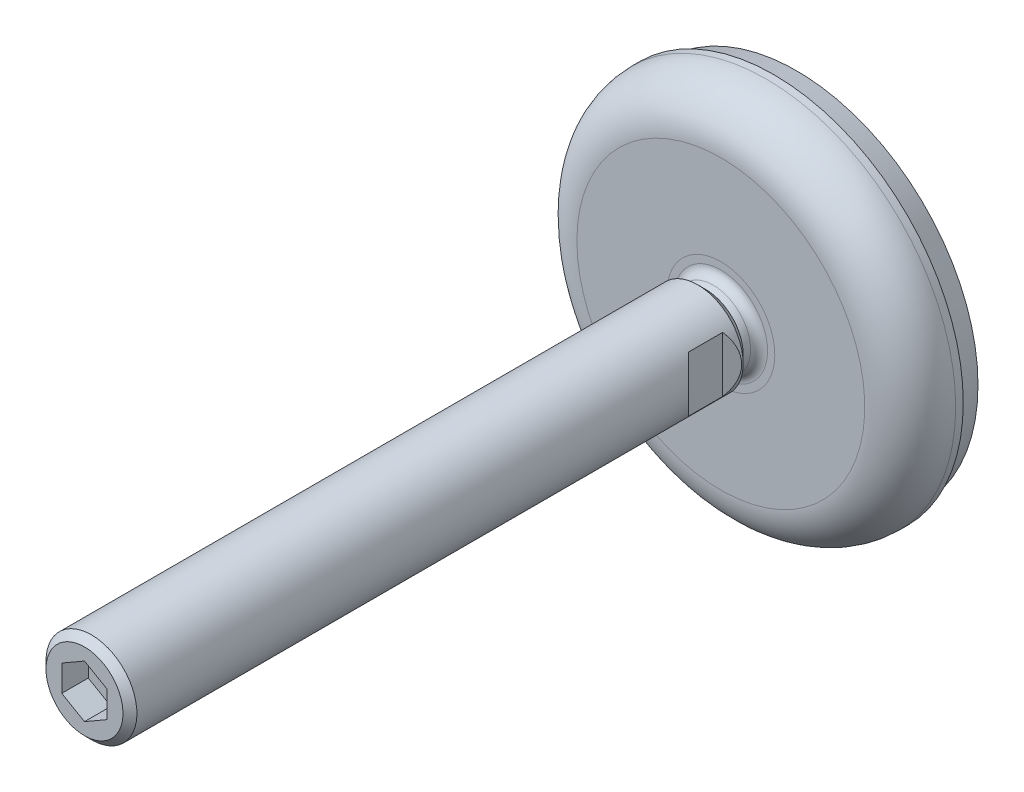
ISO-10303-21;
HEADER;
FILE_DESCRIPTION(('STEP AP214'),'2;1');
FILE_NAME('part.step','',(''),(''),'','','');
FILE_SCHEMA(('AUTOMOTIVE_DESIGN { 1 0 10303 214 1 1 1 1 }'));
ENDSEC;
DATA;
#1=APPLICATION_CONTEXT('core data for automotive mechanical design processes');
#2=APPLICATION_PROTOCOL_DEFINITION('international standard','automotive_design',2000,#1);
#3=PRODUCT_CONTEXT('',#1,'mechanical');
#4=PRODUCT('Part','Part','',(#3));
#5=PRODUCT_RELATED_PRODUCT_CATEGORY('part','',(#4));
#6=PRODUCT_DEFINITION_FORMATION('','',#4);
#7=PRODUCT_DEFINITION_CONTEXT('part definition',#1,'design');
#8=PRODUCT_DEFINITION('design','',#6,#7);
#9=PRODUCT_DEFINITION_SHAPE('','',#8);
#10=(LENGTH_UNIT() NAMED_UNIT(*) SI_UNIT(.MILLI.,.METRE.));
#11=(NAMED_UNIT(*) PLANE_ANGLE_UNIT() SI_UNIT($,.RADIAN.));
#12=(NAMED_UNIT(*) SI_UNIT($,.STERADIAN.) SOLID_ANGLE_UNIT());
#13=UNCERTAINTY_MEASURE_WITH_UNIT(LENGTH_MEASURE(1.E-05),#10,'distance_accuracy_value','');
#14=(GEOMETRIC_REPRESENTATION_CONTEXT(3) GLOBAL_UNCERTAINTY_ASSIGNED_CONTEXT((#13)) GLOBAL_UNIT_ASSIGNED_CONTEXT((#10,
#11,#12)) REPRESENTATION_CONTEXT('',''));
#15=CARTESIAN_POINT('',(0.,0.,0.));
#16=DIRECTION('',(0.,0.,1.));
#17=DIRECTION('',(1.,0.,0.));
#18=AXIS2_PLACEMENT_3D('',#15,#16,#17);
#19=CARTESIAN_POINT('',(0.,0.,19.908154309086));
#20=DIRECTION('',(0.,0.,1.));
#21=DIRECTION('',(1.,0.,0.));
#22=AXIS2_PLACEMENT_3D('',#19,#20,#21);
#23=DEGENERATE_TOROIDAL_SURFACE('',#22,0.909116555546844,11.,.F.);
#24=CARTESIAN_POINT('',(0.,0.,22.0200285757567));
#25=DIRECTION('',(0.,0.,1.));
#26=DIRECTION('',(1.,0.,0.));
#27=AXIS2_PLACEMENT_3D('',#24,#25,#26);
#28=CIRCLE('',#27,9.88625222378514);
#29=CARTESIAN_POINT('',(9.88625222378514,0.,22.0200285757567));
#30=VERTEX_POINT('',#29);
#31=EDGE_CURVE('E481',#30,#30,#28,.T.);
#32=ORIENTED_EDGE('',*,*,#31,.T.);
#33=EDGE_LOOP('',(#32));
#34=FACE_BOUND('',#33,.T.);
#35=CARTESIAN_POINT('',(0.,0.,24.));
#36=DIRECTION('',(0.,0.,1.));
#37=DIRECTION('',(1.,0.,0.));
#38=AXIS2_PLACEMENT_3D('',#35,#36,#37);
#39=CIRCLE('',#38,9.30150530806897);
#40=CARTESIAN_POINT('',(9.30150530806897,0.,24.));
#41=VERTEX_POINT('',#40);
#42=EDGE_CURVE('E429',#41,#41,#39,.F.);
#43=ORIENTED_EDGE('',*,*,#42,.T.);
#44=EDGE_LOOP('',(#43));
#45=FACE_BOUND('',#44,.T.);
#46=ADVANCED_FACE('F14',(#34,#45),#23,.F.);
#47=CARTESIAN_POINT('',(0.,0.,22.5));
#48=DIRECTION('',(0.,0.,1.));
#49=DIRECTION('',(1.,0.,0.));
#50=AXIS2_PLACEMENT_3D('',#47,#48,#49);
#51=TOROIDAL_SURFACE('',#50,12.3397451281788,2.5);
#52=CARTESIAN_POINT('',(0.,0.,20.));
#53=DIRECTION('',(0.,0.,1.));
#54=DIRECTION('',(1.,0.,0.));
#55=AXIS2_PLACEMENT_3D('',#52,#53,#54);
#56=CIRCLE('',#55,12.3397451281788);
#57=CARTESIAN_POINT('',(12.3397451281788,0.,20.));
#58=VERTEX_POINT('',#57);
#59=EDGE_CURVE('E478',#58,#58,#56,.T.);
#60=ORIENTED_EDGE('',*,*,#59,.T.);
#61=EDGE_LOOP('',(#60));
#62=FACE_BOUND('',#61,.T.);
#63=ORIENTED_EDGE('',*,*,#31,.F.);
#64=EDGE_LOOP('',(#63));
#65=FACE_BOUND('',#64,.T.);
#66=ADVANCED_FACE('F164',(#62,#65),#51,.F.);
#67=CARTESIAN_POINT('',(-12.3397451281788,0.,20.));
#68=DIRECTION('',(0.,0.,1.));
#69=DIRECTION('',(1.,0.,0.));
#70=AXIS2_PLACEMENT_3D('',#67,#68,#69);
#71=PLANE('',#70);
#72=CARTESIAN_POINT('',(0.,0.,20.));
#73=DIRECTION('',(0.,0.,1.));
#74=DIRECTION('',(1.,0.,0.));
#75=AXIS2_PLACEMENT_3D('',#72,#73,#74);
#76=CIRCLE('',#75,14.2492451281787);
#77=CARTESIAN_POINT('',(14.2492451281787,0.,20.));
#78=VERTEX_POINT('',#77);
#79=EDGE_CURVE('E432',#78,#78,#76,.T.);
#80=ORIENTED_EDGE('',*,*,#79,.T.);
#81=EDGE_LOOP('',(#80));
#82=FACE_BOUND('',#81,.T.);
#83=ORIENTED_EDGE('',*,*,#59,.F.);
#84=EDGE_LOOP('',(#83));
#85=FACE_BOUND('',#84,.T.);
#86=ADVANCED_FACE('F171',(#82,#85),#71,.T.);
#87=CARTESIAN_POINT('',(-48.4670146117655,-47.8923048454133,0.));
#88=DIRECTION('',(0.,0.,-1.));
#89=DIRECTION('',(0.,1.,0.));
#90=AXIS2_PLACEMENT_3D('',#87,#88,#89);
#91=PLANE('',#90);
#92=CARTESIAN_POINT('',(0.,0.,0.));
#93=DIRECTION('',(0.,0.,1.));
#94=DIRECTION('',(1.,0.,0.));
#95=AXIS2_PLACEMENT_3D('',#92,#93,#94);
#96=CIRCLE('',#95,47.8923048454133);
#97=CARTESIAN_POINT('',(47.8923048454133,0.,0.));
#98=VERTEX_POINT('',#97);
#99=EDGE_CURVE('E416',#98,#98,#96,.T.);
#100=ORIENTED_EDGE('',*,*,#99,.F.);
#101=EDGE_LOOP('',(#100));
#102=FACE_BOUND('',#101,.T.);
#103=ADVANCED_FACE('F299',(#102),#91,.T.);
#104=CARTESIAN_POINT('',(0.,0.,0.));
#105=DIRECTION('',(0.,0.,1.));
#106=DIRECTION('',(1.,0.,0.));
#107=AXIS2_PLACEMENT_3D('',#104,#105,#106);
#108=CONICAL_SURFACE('',#107,47.8923048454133,0.261799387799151);
#109=CARTESIAN_POINT('',(0.,0.,6.));
#110=DIRECTION('',(0.,0.,1.));
#111=DIRECTION('',(1.,0.,0.));
#112=AXIS2_PLACEMENT_3D('',#109,#110,#111);
#113=CIRCLE('',#112,49.5);
#114=CARTESIAN_POINT('',(49.5,0.,6.));
#115=VERTEX_POINT('',#114);
#116=EDGE_CURVE('E420',#115,#115,#113,.F.);
#117=ORIENTED_EDGE('',*,*,#116,.T.);
#118=EDGE_LOOP('',(#117));
#119=FACE_BOUND('',#118,.T.);
#120=ORIENTED_EDGE('',*,*,#99,.T.);
#121=EDGE_LOOP('',(#120));
#122=FACE_BOUND('',#121,.T.);
#123=ADVANCED_FACE('F16',(#119,#122),#108,.T.);
#124=CARTESIAN_POINT('',(-50.6000021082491,-50.,6.));
#125=DIRECTION('',(0.,0.,-1.));
#126=DIRECTION('',(0.,1.,0.));
#127=AXIS2_PLACEMENT_3D('',#124,#125,#126);
#128=PLANE('',#127);
#129=ORIENTED_EDGE('',*,*,#116,.F.);
#130=EDGE_LOOP('',(#129));
#131=FACE_BOUND('',#130,.T.);
#132=CARTESIAN_POINT('',(0.,0.,6.));
#133=DIRECTION('',(0.,0.,-1.));
#134=DIRECTION('',(-1.,0.,0.));
#135=AXIS2_PLACEMENT_3D('',#132,#133,#134);
#136=CIRCLE('',#135,50.);
#137=CARTESIAN_POINT('',(-50.,0.,6.));
#138=VERTEX_POINT('',#137);
#139=EDGE_CURVE('E410',#138,#138,#136,.T.);
#140=ORIENTED_EDGE('',*,*,#139,.T.);
#141=EDGE_LOOP('',(#140));
#142=FACE_BOUND('',#141,.T.);
#143=ADVANCED_FACE('F284',(#131,#142),#128,.T.);
#144=CARTESIAN_POINT('',(0.,0.,6.));
#145=DIRECTION('',(0.,0.,-1.));
#146=DIRECTION('',(-1.,0.,0.));
#147=AXIS2_PLACEMENT_3D('',#144,#145,#146);
#148=CYLINDRICAL_SURFACE('',#147,50.);
#149=ORIENTED_EDGE('',*,*,#139,.F.);
#150=EDGE_LOOP('',(#149));
#151=FACE_BOUND('',#150,.T.);
#152=CARTESIAN_POINT('',(0.,0.,8.));
#153=DIRECTION('',(0.,0.,-1.));
#154=DIRECTION('',(0.,1.,0.));
#155=AXIS2_PLACEMENT_3D('',#152,#153,#154);
#156=CIRCLE('',#155,50.);
#157=CARTESIAN_POINT('',(0.,50.,8.));
#158=VERTEX_POINT('',#157);
#159=EDGE_CURVE('E407',#158,#158,#156,.T.);
#160=ORIENTED_EDGE('',*,*,#159,.T.);
#161=EDGE_LOOP('',(#160));
#162=FACE_BOUND('',#161,.T.);
#163=ADVANCED_FACE('F276',(#151,#162),#148,.T.);
#164=CARTESIAN_POINT('',(0.,0.,8.));
#165=DIRECTION('',(0.,0.,-1.));
#166=DIRECTION('',(-1.,0.,0.));
#167=AXIS2_PLACEMENT_3D('',#164,#165,#166);
#168=TOROIDAL_SURFACE('',#167,38.,12.);
#169=CARTESIAN_POINT('',(0.,0.,20.));
#170=DIRECTION('',(0.,0.,-1.));
#171=DIRECTION('',(-1.,0.,0.));
#172=AXIS2_PLACEMENT_3D('',#169,#170,#171);
#173=CIRCLE('',#172,38.);
#174=CARTESIAN_POINT('',(-38.,0.,20.));
#175=VERTEX_POINT('',#174);
#176=EDGE_CURVE('E411',#175,#175,#173,.T.);
#177=ORIENTED_EDGE('',*,*,#176,.T.);
#178=EDGE_LOOP('',(#177));
#179=FACE_BOUND('',#178,.T.);
#180=ORIENTED_EDGE('',*,*,#159,.F.);
#181=EDGE_LOOP('',(#180));
#182=FACE_BOUND('',#181,.T.);
#183=ADVANCED_FACE('F268',(#179,#182),#168,.T.);
#184=CARTESIAN_POINT('',(-38.,38.,20.));
#185=CARTESIAN_POINT('',(-38.,-38.,20.));
#186=CARTESIAN_POINT('',(-38.,-38.76,20.));
#187=B_SPLINE_CURVE_WITH_KNOTS('',1,(#184,#185,#186),.UNSPECIFIED.,.F.,.F.,(2,1,2),(0.,1.,1.01),.UNSPECIFIED.);
#188=DIRECTION('',(1.,0.,0.));
#189=VECTOR('',#188,1.);
#190=SURFACE_OF_LINEAR_EXTRUSION('',#187,#189);
#191=ORIENTED_EDGE('',*,*,#79,.F.);
#192=EDGE_LOOP('',(#191));
#193=FACE_BOUND('',#192,.T.);
#194=ORIENTED_EDGE('',*,*,#176,.F.);
#195=EDGE_LOOP('',(#194));
#196=FACE_BOUND('',#195,.T.);
#197=ADVANCED_FACE('F260',(#193,#196),#190,.T.);
#198=CARTESIAN_POINT('',(0.,0.,24.));
#199=DIRECTION('',(0.,0.,1.));
#200=DIRECTION('',(1.,0.,0.));
#201=AXIS2_PLACEMENT_3D('',#198,#199,#200);
#202=PLANE('',#201);
#203=ORIENTED_EDGE('',*,*,#42,.F.);
#204=EDGE_LOOP('',(#203));
#205=FACE_BOUND('',#204,.T.);
#206=CARTESIAN_POINT('',(0.,0.,24.));
#207=DIRECTION('',(0.,0.,1.));
#208=DIRECTION('',(1.,0.,0.));
#209=AXIS2_PLACEMENT_3D('',#206,#207,#208);
#210=CIRCLE('',#209,9.9);
#211=CARTESIAN_POINT('',(9.9,0.,24.));
#212=VERTEX_POINT('',#211);
#213=EDGE_CURVE('E433',#212,#212,#210,.T.);
#214=ORIENTED_EDGE('',*,*,#213,.F.);
#215=EDGE_LOOP('',(#214));
#216=FACE_BOUND('',#215,.T.);
#217=ADVANCED_FACE('F252',(#205,#216),#202,.F.);
#218=CARTESIAN_POINT('',(0.,0.,24.));
#219=DIRECTION('',(0.,0.,1.));
#220=DIRECTION('',(1.,0.,0.));
#221=AXIS2_PLACEMENT_3D('',#218,#219,#220);
#222=CONICAL_SURFACE('',#221,9.9,0.785398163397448);
#223=CARTESIAN_POINT('',(0.,0.,26.1));
#224=DIRECTION('',(0.,0.,1.));
#225=DIRECTION('',(1.,0.,0.));
#226=AXIS2_PLACEMENT_3D('',#223,#224,#225);
#227=CIRCLE('',#226,12.);
#228=CARTESIAN_POINT('',(12.,0.,26.1));
#229=VERTEX_POINT('',#228);
#230=EDGE_CURVE('E469',#229,#229,#227,.T.);
#231=ORIENTED_EDGE('',*,*,#230,.F.);
#232=EDGE_LOOP('',(#231));
#233=FACE_BOUND('',#232,.T.);
#234=ORIENTED_EDGE('',*,*,#213,.T.);
#235=EDGE_LOOP('',(#234));
#236=FACE_BOUND('',#235,.T.);
#237=ADVANCED_FACE('F181',(#233,#236),#222,.T.);
#238=CARTESIAN_POINT('',(-6.,-7.01134166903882,181.));
#239=DIRECTION('',(0.,0.,1.));
#240=DIRECTION('',(1.,0.,0.));
#241=AXIS2_PLACEMENT_3D('',#238,#239,#240);
#242=PLANE('',#241);
#243=DIRECTION('',(0.866025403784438,0.5,0.));
#244=VECTOR('',#243,1.);
#245=CARTESIAN_POINT('',(-3.,5.19615242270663,181.));
#246=LINE('',#245,#244);
#247=CARTESIAN_POINT('',(-6.,3.46410161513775,181.));
#248=VERTEX_POINT('',#247);
#249=CARTESIAN_POINT('',(1.08255773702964E-07,6.92820316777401,181.));
#250=VERTEX_POINT('',#249);
#251=EDGE_CURVE('E138',#248,#250,#246,.T.);
#252=ORIENTED_EDGE('',*,*,#251,.F.);
#253=DIRECTION('',(0.,1.,0.));
#254=VECTOR('',#253,1.);
#255=CARTESIAN_POINT('',(-6.,0.,181.));
#256=LINE('',#255,#254);
#257=CARTESIAN_POINT('',(-6.,-3.46410161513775,181.));
#258=VERTEX_POINT('',#257);
#259=EDGE_CURVE('E72',#258,#248,#256,.T.);
#260=ORIENTED_EDGE('',*,*,#259,.F.);
#261=DIRECTION('',(-0.866025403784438,0.5,0.));
#262=VECTOR('',#261,1.);
#263=CARTESIAN_POINT('',(-3.,-5.19615242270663,181.));
#264=LINE('',#263,#262);
#265=CARTESIAN_POINT('',(-2.16511547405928E-07,-6.92820310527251,181.));
#266=VERTEX_POINT('',#265);
#267=EDGE_CURVE('E68',#266,#258,#264,.T.);
#268=ORIENTED_EDGE('',*,*,#267,.F.);
#269=DIRECTION('',(-0.866025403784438,-0.5,0.));
#270=VECTOR('',#269,1.);
#271=CARTESIAN_POINT('',(3.,-5.19615242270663,181.));
#272=LINE('',#271,#270);
#273=CARTESIAN_POINT('',(6.,-3.46410161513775,181.));
#274=VERTEX_POINT('',#273);
#275=EDGE_CURVE('E91',#274,#266,#272,.T.);
#276=ORIENTED_EDGE('',*,*,#275,.F.);
#277=DIRECTION('',(0.,-1.,0.));
#278=VECTOR('',#277,1.);
#279=CARTESIAN_POINT('',(6.,0.,181.));
#280=LINE('',#279,#278);
#281=CARTESIAN_POINT('',(6.,3.46410161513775,181.));
#282=VERTEX_POINT('',#281);
#283=EDGE_CURVE('E149',#282,#274,#280,.T.);
#284=ORIENTED_EDGE('',*,*,#283,.F.);
#285=DIRECTION('',(0.866025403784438,-0.5,0.));
#286=VECTOR('',#285,1.);
#287=CARTESIAN_POINT('',(3.,5.19615242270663,181.));
#288=LINE('',#287,#286);
#289=EDGE_CURVE('E142',#250,#282,#288,.T.);
#290=ORIENTED_EDGE('',*,*,#289,.F.);
#291=EDGE_LOOP('',(#252,#260,#268,#276,#284,#290));
#292=FACE_BOUND('',#291,.T.);
#293=ADVANCED_FACE('F178',(#292),#242,.T.);
#294=CARTESIAN_POINT('',(6.,3.46410161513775,188.));
#295=DIRECTION('',(-0.5,-0.866025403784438,0.));
#296=DIRECTION('',(-0.866025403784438,0.5,0.));
#297=AXIS2_PLACEMENT_3D('',#294,#295,#296);
#298=PLANE('',#297);
#299=ORIENTED_EDGE('',*,*,#289,.T.);
#300=DIRECTION('',(0.,0.,-1.));
#301=VECTOR('',#300,1.);
#302=CARTESIAN_POINT('',(6.,3.46410161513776,188.));
#303=LINE('',#302,#301);
#304=CARTESIAN_POINT('',(6.,3.46410161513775,188.));
#305=VERTEX_POINT('',#304);
#306=EDGE_CURVE('E146',#305,#282,#303,.T.);
#307=ORIENTED_EDGE('',*,*,#306,.F.);
#308=CARTESIAN_POINT('',(0.,6.92820323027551,188.));
#309=CARTESIAN_POINT('',(0.25,6.7838656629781,188.));
#310=CARTESIAN_POINT('',(0.5,6.6395280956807,188.));
#311=CARTESIAN_POINT('',(1.,6.35085296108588,188.));
#312=CARTESIAN_POINT('',(1.25,6.20651539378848,188.));
#313=CARTESIAN_POINT('',(1.75,5.91784025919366,188.));
#314=CARTESIAN_POINT('',(2.,5.77350269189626,188.));
#315=CARTESIAN_POINT('',(2.5,5.48482755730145,188.));
#316=CARTESIAN_POINT('',(2.75,5.34048999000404,188.));
#317=CARTESIAN_POINT('',(3.25,5.05181485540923,188.));
#318=CARTESIAN_POINT('',(3.5,4.90747728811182,188.));
#319=CARTESIAN_POINT('',(4.,4.61880215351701,188.));
#320=CARTESIAN_POINT('',(4.25,4.4744645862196,188.));
#321=CARTESIAN_POINT('',(4.75,4.18578945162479,188.));
#322=CARTESIAN_POINT('',(5.,4.04145188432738,188.));
#323=CARTESIAN_POINT('',(5.5,3.75277674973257,188.));
#324=CARTESIAN_POINT('',(5.75,3.60843918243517,188.));
#325=CARTESIAN_POINT('',(6.,3.46410161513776,188.));
#326=B_SPLINE_CURVE_WITH_KNOTS('',3,(#308,#309,#310,#311,#312,#313,#314,#315,#316,#317,#318,
#319,#320,#321,#322,#323,#324,#325),.UNSPECIFIED.,.F.,.F.,(4,2,2,2,2,2,2,2,4),(0.,
0.86602540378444,1.73205080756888,2.59807621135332,3.46410161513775,4.33012701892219,
5.19615242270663,6.06217782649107,6.92820323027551),.UNSPECIFIED.);
#327=CARTESIAN_POINT('',(-6.25386938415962E-08,6.92820319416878,188.));
#328=VERTEX_POINT('',#327);
#329=EDGE_CURVE('E120',#328,#305,#326,.T.);
#330=ORIENTED_EDGE('',*,*,#329,.F.);
#331=DIRECTION('',(0.,0.,-1.));
#332=VECTOR('',#331,1.);
#333=CARTESIAN_POINT('',(0.,6.92820323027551,188.));
#334=LINE('',#333,#332);
#335=EDGE_CURVE('E135',#328,#250,#334,.T.);
#336=ORIENTED_EDGE('',*,*,#335,.T.);
#337=EDGE_LOOP('',(#299,#307,#330,#336));
#338=FACE_BOUND('',#337,.T.);
#339=ADVANCED_FACE('F144',(#338),#298,.T.);
#340=CARTESIAN_POINT('',(0.,6.92820323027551,188.));
#341=DIRECTION('',(0.5,-0.866025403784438,0.));
#342=DIRECTION('',(-0.866025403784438,-0.5,0.));
#343=AXIS2_PLACEMENT_3D('',#340,#341,#342);
#344=PLANE('',#343);
#345=ORIENTED_EDGE('',*,*,#251,.T.);
#346=ORIENTED_EDGE('',*,*,#335,.F.);
#347=CARTESIAN_POINT('',(-6.,3.46410161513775,188.));
#348=CARTESIAN_POINT('',(-5.75,3.60843918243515,188.));
#349=CARTESIAN_POINT('',(-5.5,3.75277674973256,188.));
#350=CARTESIAN_POINT('',(-5.,4.04145188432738,188.));
#351=CARTESIAN_POINT('',(-4.75,4.18578945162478,188.));
#352=CARTESIAN_POINT('',(-4.25,4.4744645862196,188.));
#353=CARTESIAN_POINT('',(-4.,4.618802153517,188.));
#354=CARTESIAN_POINT('',(-3.5,4.90747728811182,188.));
#355=CARTESIAN_POINT('',(-3.25,5.05181485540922,188.));
#356=CARTESIAN_POINT('',(-2.75,5.34048999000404,188.));
#357=CARTESIAN_POINT('',(-2.5,5.48482755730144,188.));
#358=CARTESIAN_POINT('',(-2.,5.77350269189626,188.));
#359=CARTESIAN_POINT('',(-1.75,5.91784025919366,188.));
#360=CARTESIAN_POINT('',(-1.25,6.20651539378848,188.));
#361=CARTESIAN_POINT('',(-1.,6.35085296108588,188.));
#362=CARTESIAN_POINT('',(-0.5,6.63952809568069,188.));
#363=CARTESIAN_POINT('',(-0.249999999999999,6.7838656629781,188.));
#364=CARTESIAN_POINT('',(0.,6.92820323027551,188.));
#365=B_SPLINE_CURVE_WITH_KNOTS('',3,(#347,#348,#349,#350,#351,#352,#353,#354,#355,#356,#357,
#358,#359,#360,#361,#362,#363,#364),.UNSPECIFIED.,.F.,.F.,(4,2,2,2,2,2,2,2,4),(0.,
0.866025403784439,1.73205080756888,2.59807621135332,3.46410161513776,4.33012701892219,
5.19615242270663,6.06217782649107,6.92820323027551),.UNSPECIFIED.);
#366=CARTESIAN_POINT('',(-6.,3.46410161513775,188.));
#367=VERTEX_POINT('',#366);
#368=EDGE_CURVE('E82',#367,#328,#365,.T.);
#369=ORIENTED_EDGE('',*,*,#368,.F.);
#370=DIRECTION('',(0.,0.,-1.));
#371=VECTOR('',#370,1.);
#372=CARTESIAN_POINT('',(-6.,3.46410161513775,188.));
#373=LINE('',#372,#371);
#374=EDGE_CURVE('E78',#367,#248,#373,.T.);
#375=ORIENTED_EDGE('',*,*,#374,.T.);
#376=EDGE_LOOP('',(#345,#346,#369,#375));
#377=FACE_BOUND('',#376,.T.);
#378=ADVANCED_FACE('F132',(#377),#344,.T.);
#379=CARTESIAN_POINT('',(-6.,3.46410161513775,188.));
#380=DIRECTION('',(1.,0.,0.));
#381=DIRECTION('',(0.,-1.,0.));
#382=AXIS2_PLACEMENT_3D('',#379,#380,#381);
#383=PLANE('',#382);
#384=ORIENTED_EDGE('',*,*,#259,.T.);
#385=ORIENTED_EDGE('',*,*,#374,.F.);
#386=DIRECTION('',(0.,1.,0.));
#387=VECTOR('',#386,1.);
#388=CARTESIAN_POINT('',(-6.,0.,188.));
#389=LINE('',#388,#387);
#390=CARTESIAN_POINT('',(-6.,-3.46410161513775,188.));
#391=VERTEX_POINT('',#390);
#392=EDGE_CURVE('E75',#391,#367,#389,.T.);
#393=ORIENTED_EDGE('',*,*,#392,.F.);
#394=DIRECTION('',(0.,0.,-1.));
#395=VECTOR('',#394,1.);
#396=CARTESIAN_POINT('',(-6.,-3.46410161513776,188.));
#397=LINE('',#396,#395);
#398=EDGE_CURVE('E59',#391,#258,#397,.T.);
#399=ORIENTED_EDGE('',*,*,#398,.T.);
#400=EDGE_LOOP('',(#384,#385,#393,#399));
#401=FACE_BOUND('',#400,.T.);
#402=ADVANCED_FACE('F76',(#401),#383,.T.);
#403=CARTESIAN_POINT('',(-6.,-3.46410161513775,188.));
#404=DIRECTION('',(0.5,0.866025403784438,0.));
#405=DIRECTION('',(0.866025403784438,-0.5,0.));
#406=AXIS2_PLACEMENT_3D('',#403,#404,#405);
#407=PLANE('',#406);
#408=ORIENTED_EDGE('',*,*,#267,.T.);
#409=ORIENTED_EDGE('',*,*,#398,.F.);
#410=CARTESIAN_POINT('',(0.,-6.92820323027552,188.));
#411=CARTESIAN_POINT('',(-0.250000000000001,-6.78386566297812,188.));
#412=CARTESIAN_POINT('',(-0.500000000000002,-6.63952809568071,188.));
#413=CARTESIAN_POINT('',(-1.,-6.3508529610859,188.));
#414=CARTESIAN_POINT('',(-1.25,-6.20651539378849,188.));
#415=CARTESIAN_POINT('',(-1.75,-5.91784025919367,188.));
#416=CARTESIAN_POINT('',(-2.,-5.77350269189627,188.));
#417=CARTESIAN_POINT('',(-2.5,-5.48482755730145,188.));
#418=CARTESIAN_POINT('',(-2.75,-5.34048999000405,188.));
#419=CARTESIAN_POINT('',(-3.25,-5.05181485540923,188.));
#420=CARTESIAN_POINT('',(-3.5,-4.90747728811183,188.));
#421=CARTESIAN_POINT('',(-4.,-4.61880215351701,188.));
#422=CARTESIAN_POINT('',(-4.25,-4.47446458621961,188.));
#423=CARTESIAN_POINT('',(-4.75,-4.18578945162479,188.));
#424=CARTESIAN_POINT('',(-5.,-4.04145188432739,188.));
#425=CARTESIAN_POINT('',(-5.5,-3.75277674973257,188.));
#426=CARTESIAN_POINT('',(-5.75,-3.60843918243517,188.));
#427=CARTESIAN_POINT('',(-6.,-3.46410161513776,188.));
#428=B_SPLINE_CURVE_WITH_KNOTS('',3,(#410,#411,#412,#413,#414,#415,#416,#417,#418,#419,#420,
#421,#422,#423,#424,#425,#426,#427),.UNSPECIFIED.,.F.,.F.,(4,2,2,2,2,2,2,2,4),(0.,
0.86602540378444,1.73205080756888,2.59807621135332,3.46410161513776,4.3301270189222,
5.19615242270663,6.06217782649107,6.92820323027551),.UNSPECIFIED.);
#429=CARTESIAN_POINT('',(-6.25386938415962E-08,-6.92820319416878,188.));
#430=VERTEX_POINT('',#429);
#431=EDGE_CURVE('E64',#430,#391,#428,.T.);
#432=ORIENTED_EDGE('',*,*,#431,.F.);
#433=DIRECTION('',(0.,0.,-1.));
#434=VECTOR('',#433,1.);
#435=CARTESIAN_POINT('',(0.,-6.92820323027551,188.));
#436=LINE('',#435,#434);
#437=EDGE_CURVE('E89',#266,#430,#436,.F.);
#438=ORIENTED_EDGE('',*,*,#437,.F.);
#439=EDGE_LOOP('',(#408,#409,#432,#438));
#440=FACE_BOUND('',#439,.T.);
#441=ADVANCED_FACE('F61',(#440),#407,.T.);
#442=CARTESIAN_POINT('',(0.,-6.92820323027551,188.));
#443=DIRECTION('',(-0.5,0.866025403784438,0.));
#444=DIRECTION('',(0.866025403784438,0.5,0.));
#445=AXIS2_PLACEMENT_3D('',#442,#443,#444);
#446=PLANE('',#445);
#447=ORIENTED_EDGE('',*,*,#275,.T.);
#448=ORIENTED_EDGE('',*,*,#437,.T.);
#449=CARTESIAN_POINT('',(6.,-3.46410161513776,188.));
#450=CARTESIAN_POINT('',(5.75,-3.60843918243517,188.));
#451=CARTESIAN_POINT('',(5.5,-3.75277674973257,188.));
#452=CARTESIAN_POINT('',(5.,-4.04145188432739,188.));
#453=CARTESIAN_POINT('',(4.75,-4.18578945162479,188.));
#454=CARTESIAN_POINT('',(4.25,-4.47446458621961,188.));
#455=CARTESIAN_POINT('',(4.,-4.61880215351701,188.));
#456=CARTESIAN_POINT('',(3.5,-4.90747728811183,188.));
#457=CARTESIAN_POINT('',(3.25,-5.05181485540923,188.));
#458=CARTESIAN_POINT('',(2.75,-5.34048999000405,188.));
#459=CARTESIAN_POINT('',(2.5,-5.48482755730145,188.));
#460=CARTESIAN_POINT('',(2.,-5.77350269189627,188.));
#461=CARTESIAN_POINT('',(1.75,-5.91784025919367,188.));
#462=CARTESIAN_POINT('',(1.25,-6.20651539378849,188.));
#463=CARTESIAN_POINT('',(0.999999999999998,-6.3508529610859,188.));
#464=CARTESIAN_POINT('',(0.499999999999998,-6.63952809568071,188.));
#465=CARTESIAN_POINT('',(0.249999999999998,-6.78386566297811,188.));
#466=CARTESIAN_POINT('',(0.,-6.92820323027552,188.));
#467=B_SPLINE_CURVE_WITH_KNOTS('',3,(#449,#450,#451,#452,#453,#454,#455,#456,#457,#458,#459,
#460,#461,#462,#463,#464,#465,#466),.UNSPECIFIED.,.F.,.F.,(4,2,2,2,2,2,2,2,4),(0.,
0.866025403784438,1.73205080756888,2.59807621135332,3.46410161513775,4.33012701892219,
5.19615242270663,6.06217782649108,6.92820323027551),.UNSPECIFIED.);
#468=CARTESIAN_POINT('',(6.,-3.46410161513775,188.));
#469=VERTEX_POINT('',#468);
#470=EDGE_CURVE('E88',#469,#430,#467,.T.);
#471=ORIENTED_EDGE('',*,*,#470,.F.);
#472=DIRECTION('',(0.,0.,-1.));
#473=VECTOR('',#472,1.);
#474=CARTESIAN_POINT('',(6.,-3.46410161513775,188.));
#475=LINE('',#474,#473);
#476=EDGE_CURVE('E37',#469,#274,#475,.T.);
#477=ORIENTED_EDGE('',*,*,#476,.T.);
#478=EDGE_LOOP('',(#447,#448,#471,#477));
#479=FACE_BOUND('',#478,.T.);
#480=ADVANCED_FACE('F111',(#479),#446,.T.);
#481=CARTESIAN_POINT('',(6.,-3.46410161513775,188.));
#482=DIRECTION('',(-1.,0.,0.));
#483=DIRECTION('',(0.,1.,0.));
#484=AXIS2_PLACEMENT_3D('',#481,#482,#483);
#485=PLANE('',#484);
#486=ORIENTED_EDGE('',*,*,#283,.T.);
#487=ORIENTED_EDGE('',*,*,#476,.F.);
#488=DIRECTION('',(0.,-1.,0.));
#489=VECTOR('',#488,1.);
#490=CARTESIAN_POINT('',(6.,0.,188.));
#491=LINE('',#490,#489);
#492=EDGE_CURVE('E123',#305,#469,#491,.T.);
#493=ORIENTED_EDGE('',*,*,#492,.F.);
#494=ORIENTED_EDGE('',*,*,#306,.T.);
#495=EDGE_LOOP('',(#486,#487,#493,#494));
#496=FACE_BOUND('',#495,.T.);
#497=ADVANCED_FACE('F151',(#496),#485,.T.);
#498=CARTESIAN_POINT('',(-10.2814161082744,10.1595,188.));
#499=DIRECTION('',(0.,0.,1.));
#500=DIRECTION('',(0.,-1.,0.));
#501=AXIS2_PLACEMENT_3D('',#498,#499,#500);
#502=PLANE('',#501);
#503=ORIENTED_EDGE('',*,*,#492,.T.);
#504=ORIENTED_EDGE('',*,*,#470,.T.);
#505=ORIENTED_EDGE('',*,*,#431,.T.);
#506=ORIENTED_EDGE('',*,*,#392,.T.);
#507=ORIENTED_EDGE('',*,*,#368,.T.);
#508=ORIENTED_EDGE('',*,*,#329,.T.);
#509=EDGE_LOOP('',(#503,#504,#505,#506,#507,#508));
#510=FACE_BOUND('',#509,.T.);
#511=CARTESIAN_POINT('',(0.,0.,188.));
#512=DIRECTION('',(0.,0.,-1.));
#513=DIRECTION('',(-1.,0.,0.));
#514=AXIS2_PLACEMENT_3D('',#511,#512,#513);
#515=CIRCLE('',#514,10.1595);
#516=CARTESIAN_POINT('',(-10.1595,0.,188.));
#517=VERTEX_POINT('',#516);
#518=EDGE_CURVE('E415',#517,#517,#515,.T.);
#519=ORIENTED_EDGE('',*,*,#518,.F.);
#520=EDGE_LOOP('',(#519));
#521=FACE_BOUND('',#520,.T.);
#522=ADVANCED_FACE('F86',(#510,#521),#502,.T.);
#523=CARTESIAN_POINT('',(0.,0.,188.));
#524=DIRECTION('',(0.,0.,-1.));
#525=DIRECTION('',(-1.,0.,0.));
#526=AXIS2_PLACEMENT_3D('',#523,#524,#525);
#527=CONICAL_SURFACE('',#526,10.1595,0.785398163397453);
#528=CARTESIAN_POINT('',(0.,0.,186.1595));
#529=DIRECTION('',(0.,0.,-1.));
#530=DIRECTION('',(0.,1.,0.));
#531=AXIS2_PLACEMENT_3D('',#528,#529,#530);
#532=CIRCLE('',#531,12.);
#533=CARTESIAN_POINT('',(0.,12.,186.1595));
#534=VERTEX_POINT('',#533);
#535=EDGE_CURVE('E412',#534,#534,#532,.T.);
#536=ORIENTED_EDGE('',*,*,#535,.F.);
#537=EDGE_LOOP('',(#536));
#538=FACE_BOUND('',#537,.T.);
#539=ORIENTED_EDGE('',*,*,#518,.T.);
#540=EDGE_LOOP('',(#539));
#541=FACE_BOUND('',#540,.T.);
#542=ADVANCED_FACE('F160',(#538,#541),#527,.T.);
#543=CARTESIAN_POINT('',(0.,0.,27.8405));
#544=DIRECTION('',(0.,0.,-1.));
#545=DIRECTION('',(-1.,0.,0.));
#546=AXIS2_PLACEMENT_3D('',#543,#544,#545);
#547=CYLINDRICAL_SURFACE('',#546,12.);
#548=DIRECTION('',(0.,0.,-1.));
#549=VECTOR('',#548,1.);
#550=CARTESIAN_POINT('',(9.5,7.33143914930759,27.8405));
#551=LINE('',#550,#549);
#552=CARTESIAN_POINT('',(9.5,7.33143914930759,29.));
#553=VERTEX_POINT('',#552);
#554=CARTESIAN_POINT('',(9.5,7.33143914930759,38.));
#555=VERTEX_POINT('',#554);
#556=EDGE_CURVE('E9',#553,#555,#551,.F.);
#557=ORIENTED_EDGE('',*,*,#556,.F.);
#558=CARTESIAN_POINT('',(0.,0.,38.5));
#559=DIRECTION('',(-0.707106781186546,0.,-0.707106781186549));
#560=DIRECTION('',(0.707106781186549,0.,-0.707106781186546));
#561=AXIS2_PLACEMENT_3D('',#558,#559,#560);
#562=ELLIPSE('',#561,16.9705627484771,12.);
#563=CARTESIAN_POINT('',(9.5,-7.33143914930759,29.));
#564=VERTEX_POINT('',#563);
#565=EDGE_CURVE('E445',#564,#553,#562,.F.);
#566=ORIENTED_EDGE('',*,*,#565,.F.);
#567=DIRECTION('',(0.,0.,-1.));
#568=VECTOR('',#567,1.);
#569=CARTESIAN_POINT('',(9.5,-7.33143914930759,27.8405));
#570=LINE('',#569,#568);
#571=CARTESIAN_POINT('',(9.5,-7.33143914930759,38.));
#572=VERTEX_POINT('',#571);
#573=EDGE_CURVE('E447',#572,#564,#570,.T.);
#574=ORIENTED_EDGE('',*,*,#573,.F.);
#575=CARTESIAN_POINT('',(0.,0.,28.5));
#576=DIRECTION('',(-0.70710678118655,0.,0.707106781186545));
#577=DIRECTION('',(-0.707106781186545,0.,-0.70710678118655));
#578=AXIS2_PLACEMENT_3D('',#575,#576,#577);
#579=ELLIPSE('',#578,16.9705627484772,12.);
#580=EDGE_CURVE('E22',#555,#572,#579,.F.);
#581=ORIENTED_EDGE('',*,*,#580,.F.);
#582=EDGE_LOOP('',(#557,#566,#574,#581));
#583=FACE_BOUND('',#582,.T.);
#584=DIRECTION('',(0.,0.,-1.));
#585=VECTOR('',#584,1.);
#586=CARTESIAN_POINT('',(-9.5,-7.33143914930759,27.8405));
#587=LINE('',#586,#585);
#588=CARTESIAN_POINT('',(-9.5,-7.33143914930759,29.));
#589=VERTEX_POINT('',#588);
#590=CARTESIAN_POINT('',(-9.5,-7.33143914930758,38.));
#591=VERTEX_POINT('',#590);
#592=EDGE_CURVE('E439',#589,#591,#587,.F.);
#593=ORIENTED_EDGE('',*,*,#592,.F.);
#594=CARTESIAN_POINT('',(0.,0.,38.5));
#595=DIRECTION('',(0.707106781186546,0.,-0.707106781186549));
#596=DIRECTION('',(-0.707106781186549,0.,-0.707106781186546));
#597=AXIS2_PLACEMENT_3D('',#594,#595,#596);
#598=ELLIPSE('',#597,16.9705627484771,12.);
#599=CARTESIAN_POINT('',(-9.5,7.33143914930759,29.));
#600=VERTEX_POINT('',#599);
#601=EDGE_CURVE('E442',#600,#589,#598,.F.);
#602=ORIENTED_EDGE('',*,*,#601,.F.);
#603=DIRECTION('',(0.,0.,-1.));
#604=VECTOR('',#603,1.);
#605=CARTESIAN_POINT('',(-9.5,7.33143914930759,27.8405));
#606=LINE('',#605,#604);
#607=CARTESIAN_POINT('',(-9.5,7.33143914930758,38.));
#608=VERTEX_POINT('',#607);
#609=EDGE_CURVE('E436',#608,#600,#606,.T.);
#610=ORIENTED_EDGE('',*,*,#609,.F.);
#611=CARTESIAN_POINT('',(0.,0.,28.5));
#612=DIRECTION('',(0.70710678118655,0.,0.707106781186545));
#613=DIRECTION('',(0.707106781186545,0.,-0.70710678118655));
#614=AXIS2_PLACEMENT_3D('',#611,#612,#613);
#615=ELLIPSE('',#614,16.9705627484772,12.);
#616=EDGE_CURVE('E419',#591,#608,#615,.F.);
#617=ORIENTED_EDGE('',*,*,#616,.F.);
#618=EDGE_LOOP('',(#593,#602,#610,#617));
#619=FACE_BOUND('',#618,.T.);
#620=ORIENTED_EDGE('',*,*,#230,.T.);
#621=EDGE_LOOP('',(#620));
#622=FACE_BOUND('',#621,.T.);
#623=ORIENTED_EDGE('',*,*,#535,.T.);
#624=EDGE_LOOP('',(#623));
#625=FACE_BOUND('',#624,.T.);
#626=ADVANCED_FACE('F342',(#583,#619,#622,#625),#547,.T.);
#627=CARTESIAN_POINT('',(-12.,-15.,26.5));
#628=DIRECTION('',(0.707106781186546,0.,-0.707106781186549));
#629=DIRECTION('',(-0.707106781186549,0.,-0.707106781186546));
#630=AXIS2_PLACEMENT_3D('',#627,#628,#629);
#631=PLANE('',#630);
#632=ORIENTED_EDGE('',*,*,#601,.T.);
#633=DIRECTION('',(0.,1.,0.));
#634=VECTOR('',#633,1.);
#635=CARTESIAN_POINT('',(-9.5,-15.,29.));
#636=LINE('',#635,#634);
#637=EDGE_CURVE('E466',#589,#600,#636,.T.);
#638=ORIENTED_EDGE('',*,*,#637,.T.);
#639=EDGE_LOOP('',(#632,#638));
#640=FACE_BOUND('',#639,.T.);
#641=ADVANCED_FACE('F332',(#640),#631,.F.);
#642=CARTESIAN_POINT('',(-9.5,-15.,29.));
#643=DIRECTION('',(1.,0.,0.));
#644=DIRECTION('',(0.,0.,-1.));
#645=AXIS2_PLACEMENT_3D('',#642,#643,#644);
#646=PLANE('',#645);
#647=ORIENTED_EDGE('',*,*,#592,.T.);
#648=DIRECTION('',(0.,1.,0.));
#649=VECTOR('',#648,1.);
#650=CARTESIAN_POINT('',(-9.5,-15.,38.));
#651=LINE('',#650,#649);
#652=EDGE_CURVE('E460',#591,#608,#651,.T.);
#653=ORIENTED_EDGE('',*,*,#652,.T.);
#654=ORIENTED_EDGE('',*,*,#609,.T.);
#655=ORIENTED_EDGE('',*,*,#637,.F.);
#656=EDGE_LOOP('',(#647,#653,#654,#655));
#657=FACE_BOUND('',#656,.T.);
#658=ADVANCED_FACE('F320',(#657),#646,.F.);
#659=CARTESIAN_POINT('',(-9.5,-15.,38.));
#660=DIRECTION('',(0.70710678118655,0.,0.707106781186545));
#661=DIRECTION('',(0.707106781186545,0.,-0.70710678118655));
#662=AXIS2_PLACEMENT_3D('',#659,#660,#661);
#663=PLANE('',#662);
#664=ORIENTED_EDGE('',*,*,#652,.F.);
#665=ORIENTED_EDGE('',*,*,#616,.T.);
#666=EDGE_LOOP('',(#664,#665));
#667=FACE_BOUND('',#666,.T.);
#668=ADVANCED_FACE('F314',(#667),#663,.F.);
#669=CARTESIAN_POINT('',(9.5,-15.,38.));
#670=DIRECTION('',(-0.70710678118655,0.,0.707106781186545));
#671=DIRECTION('',(0.707106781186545,0.,0.70710678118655));
#672=AXIS2_PLACEMENT_3D('',#669,#670,#671);
#673=PLANE('',#672);
#674=DIRECTION('',(0.,1.,0.));
#675=VECTOR('',#674,1.);
#676=CARTESIAN_POINT('',(9.5,-15.,38.));
#677=LINE('',#676,#675);
#678=EDGE_CURVE('E454',#572,#555,#677,.T.);
#679=ORIENTED_EDGE('',*,*,#678,.T.);
#680=ORIENTED_EDGE('',*,*,#580,.T.);
#681=EDGE_LOOP('',(#679,#680));
#682=FACE_BOUND('',#681,.T.);
#683=ADVANCED_FACE('F319',(#682),#673,.F.);
#684=CARTESIAN_POINT('',(9.5,-15.,29.));
#685=DIRECTION('',(-1.,0.,0.));
#686=DIRECTION('',(0.,0.,1.));
#687=AXIS2_PLACEMENT_3D('',#684,#685,#686);
#688=PLANE('',#687);
#689=ORIENTED_EDGE('',*,*,#556,.T.);
#690=ORIENTED_EDGE('',*,*,#678,.F.);
#691=ORIENTED_EDGE('',*,*,#573,.T.);
#692=DIRECTION('',(0.,1.,0.));
#693=VECTOR('',#692,1.);
#694=CARTESIAN_POINT('',(9.5,-15.,29.));
#695=LINE('',#694,#693);
#696=EDGE_CURVE('E28',#564,#553,#695,.T.);
#697=ORIENTED_EDGE('',*,*,#696,.T.);
#698=EDGE_LOOP('',(#689,#690,#691,#697));
#699=FACE_BOUND('',#698,.T.);
#700=ADVANCED_FACE('F352',(#699),#688,.F.);
#701=CARTESIAN_POINT('',(12.,-15.,26.5));
#702=DIRECTION('',(-0.707106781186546,0.,-0.707106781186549));
#703=DIRECTION('',(-0.707106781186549,0.,0.707106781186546));
#704=AXIS2_PLACEMENT_3D('',#701,#702,#703);
#705=PLANE('',#704);
#706=ORIENTED_EDGE('',*,*,#565,.T.);
#707=ORIENTED_EDGE('',*,*,#696,.F.);
#708=EDGE_LOOP('',(#706,#707));
#709=FACE_BOUND('',#708,.T.);
#710=ADVANCED_FACE('F360',(#709),#705,.F.);
#711=CLOSED_SHELL('',(#46,#66,#86,#103,#123,#143,#163,#183,#197,#217,#237,#293,#339,#378,#402,
#441,#480,#497,#522,#542,#626,#641,#658,#668,#683,#700,#710));
#712=MANIFOLD_SOLID_BREP('B1',#711);
#713=ADVANCED_BREP_SHAPE_REPRESENTATION('',(#18,#712),#14);
#714=SHAPE_DEFINITION_REPRESENTATION(#9,#713);
ENDSEC;
END-ISO-10303-21;
